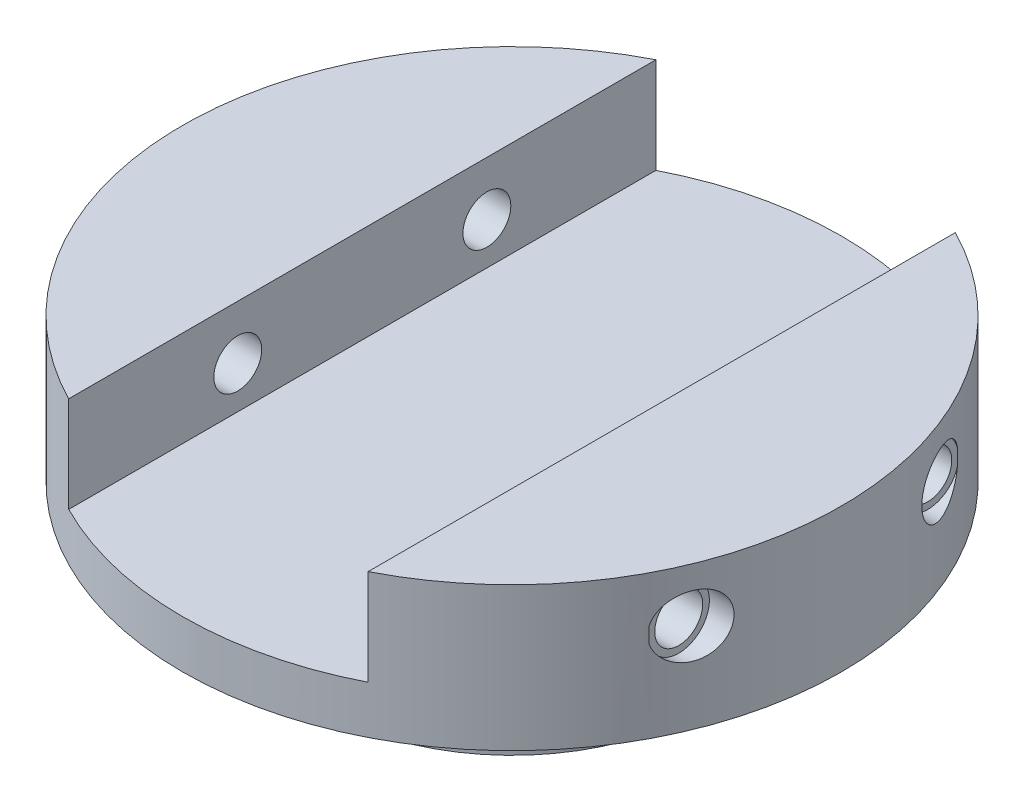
ISO-10303-21;
HEADER;
FILE_DESCRIPTION(('STEP AP214'),'2;1');
FILE_NAME('part.step','',(''),(''),'','','');
FILE_SCHEMA(('AUTOMOTIVE_DESIGN { 1 0 10303 214 1 1 1 1 }'));
ENDSEC;
DATA;
#1=APPLICATION_CONTEXT('core data for automotive mechanical design processes');
#2=APPLICATION_PROTOCOL_DEFINITION('international standard','automotive_design',2000,#1);
#3=PRODUCT_CONTEXT('',#1,'mechanical');
#4=PRODUCT('Part','Part','',(#3));
#5=PRODUCT_RELATED_PRODUCT_CATEGORY('part','',(#4));
#6=PRODUCT_DEFINITION_FORMATION('','',#4);
#7=PRODUCT_DEFINITION_CONTEXT('part definition',#1,'design');
#8=PRODUCT_DEFINITION('design','',#6,#7);
#9=PRODUCT_DEFINITION_SHAPE('','',#8);
#10=(LENGTH_UNIT() NAMED_UNIT(*) SI_UNIT(.MILLI.,.METRE.));
#11=(NAMED_UNIT(*) PLANE_ANGLE_UNIT() SI_UNIT($,.RADIAN.));
#12=(NAMED_UNIT(*) SI_UNIT($,.STERADIAN.) SOLID_ANGLE_UNIT());
#13=UNCERTAINTY_MEASURE_WITH_UNIT(LENGTH_MEASURE(1.E-05),#10,'distance_accuracy_value','');
#14=(GEOMETRIC_REPRESENTATION_CONTEXT(3) GLOBAL_UNCERTAINTY_ASSIGNED_CONTEXT((#13)) GLOBAL_UNIT_ASSIGNED_CONTEXT((#10,
#11,#12)) REPRESENTATION_CONTEXT('',''));
#15=CARTESIAN_POINT('',(0.,0.,0.));
#16=DIRECTION('',(0.,0.,1.));
#17=DIRECTION('',(1.,0.,0.));
#18=AXIS2_PLACEMENT_3D('',#15,#16,#17);
#19=CARTESIAN_POINT('',(0.,0.,0.));
#20=DIRECTION('',(0.,1.,0.));
#21=DIRECTION('',(0.,0.,1.));
#22=AXIS2_PLACEMENT_3D('',#19,#20,#21);
#23=PLANE('',#22);
#24=CARTESIAN_POINT('',(0.,0.,0.));
#25=DIRECTION('',(0.,1.,0.));
#26=DIRECTION('',(0.,0.,1.));
#27=AXIS2_PLACEMENT_3D('',#24,#25,#26);
#28=CIRCLE('',#27,43.688);
#29=CARTESIAN_POINT('',(0.,0.,43.688));
#30=VERTEX_POINT('',#29);
#31=EDGE_CURVE('E126',#30,#30,#28,.T.);
#32=ORIENTED_EDGE('',*,*,#31,.F.);
#33=EDGE_LOOP('',(#32));
#34=FACE_BOUND('',#33,.T.);
#35=CARTESIAN_POINT('',(0.,0.,0.));
#36=DIRECTION('',(0.,1.,0.));
#37=DIRECTION('',(0.,0.,1.));
#38=AXIS2_PLACEMENT_3D('',#35,#36,#37);
#39=CIRCLE('',#38,25.3746);
#40=CARTESIAN_POINT('',(0.,0.,25.3746));
#41=VERTEX_POINT('',#40);
#42=EDGE_CURVE('E140',#41,#41,#39,.F.);
#43=ORIENTED_EDGE('',*,*,#42,.F.);
#44=EDGE_LOOP('',(#43));
#45=FACE_BOUND('',#44,.T.);
#46=ADVANCED_FACE('F32',(#34,#45),#23,.F.);
#47=CARTESIAN_POINT('',(0.,19.05,0.));
#48=DIRECTION('',(0.,-1.,0.));
#49=DIRECTION('',(0.,0.,-1.));
#50=AXIS2_PLACEMENT_3D('',#47,#48,#49);
#51=CYLINDRICAL_SURFACE('',#50,43.688);
#52=DIRECTION('',(0.,-1.,0.));
#53=VECTOR('',#52,1.);
#54=CARTESIAN_POINT('',(-38.608,19.05,20.4466055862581));
#55=LINE('',#54,#53);
#56=CARTESIAN_POINT('',(-38.608,12.9221704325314,20.4466055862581));
#57=VERTEX_POINT('',#56);
#58=CARTESIAN_POINT('',(-38.608,10.9030295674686,20.4466055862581));
#59=VERTEX_POINT('',#58);
#60=EDGE_CURVE('E45',#57,#59,#55,.T.);
#61=ORIENTED_EDGE('',*,*,#60,.T.);
#62=CARTESIAN_POINT('',(-38.5402629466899,11.9126,20.574));
#63=CARTESIAN_POINT('',(-38.5402622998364,11.8076831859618,20.5740009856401));
#64=CARTESIAN_POINT('',(-38.542434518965,11.7027783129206,20.5699335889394));
#65=CARTESIAN_POINT('',(-38.5510852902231,11.4937384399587,20.5537162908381));
#66=CARTESIAN_POINT('',(-38.5575650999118,11.3896036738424,20.5415640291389));
#67=CARTESIAN_POINT('',(-38.5747304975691,11.182828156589,20.5093111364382));
#68=CARTESIAN_POINT('',(-38.5854200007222,11.0801888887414,20.4892031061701));
#69=CARTESIAN_POINT('',(-38.6108322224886,10.8771985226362,20.4412747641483));
#70=CARTESIAN_POINT('',(-38.6255565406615,10.776848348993,20.4134513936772));
#71=CARTESIAN_POINT('',(-38.6587452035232,10.5795148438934,20.3505287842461));
#72=CARTESIAN_POINT('',(-38.6771953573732,10.4825203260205,20.3154571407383));
#73=CARTESIAN_POINT('',(-38.7175990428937,10.2920810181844,20.2383487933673));
#74=CARTESIAN_POINT('',(-38.7395538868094,10.1986375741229,20.1963094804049));
#75=CARTESIAN_POINT('',(-38.8102184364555,9.92452760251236,20.0603768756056));
#76=CARTESIAN_POINT('',(-38.8637631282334,9.74987813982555,19.9566032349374));
#77=CARTESIAN_POINT('',(-38.9842541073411,9.41152651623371,19.7202367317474));
#78=CARTESIAN_POINT('',(-39.0517616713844,9.24890050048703,19.5864047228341));
#79=CARTESIAN_POINT('',(-39.1952806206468,8.94799212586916,19.2975990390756));
#80=CARTESIAN_POINT('',(-39.2712953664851,8.80971944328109,19.1426170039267));
#81=CARTESIAN_POINT('',(-39.437795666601,8.5456779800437,18.797398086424));
#82=CARTESIAN_POINT('',(-39.5289536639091,8.42294943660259,18.6051586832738));
#83=CARTESIAN_POINT('',(-39.7151125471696,8.21172511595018,18.2043964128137));
#84=CARTESIAN_POINT('',(-39.8101151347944,8.12324468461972,17.9958662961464));
#85=CARTESIAN_POINT('',(-40.0086460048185,7.97647124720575,17.5503160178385));
#86=CARTESIAN_POINT('',(-40.1122514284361,7.92113878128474,17.3123490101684));
#87=CARTESIAN_POINT('',(-40.3172653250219,7.85383824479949,16.8293880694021));
#88=CARTESIAN_POINT('',(-40.4186734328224,7.84187732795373,16.5843929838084));
#89=CARTESIAN_POINT('',(-40.6177841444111,7.86264567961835,16.0906423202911));
#90=CARTESIAN_POINT('',(-40.7154135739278,7.89601270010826,15.8418827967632));
#91=CARTESIAN_POINT('',(-40.9026719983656,8.00899812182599,15.3519224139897));
#92=CARTESIAN_POINT('',(-40.9923027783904,8.08860617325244,15.1107198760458));
#93=CARTESIAN_POINT('',(-41.1575069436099,8.28867043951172,14.6545996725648));
#94=CARTESIAN_POINT('',(-41.2335238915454,8.40718632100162,14.4389936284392));
#95=CARTESIAN_POINT('',(-41.374361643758,8.68334469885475,14.0303341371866));
#96=CARTESIAN_POINT('',(-41.439186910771,8.84097153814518,13.8372717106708));
#97=CARTESIAN_POINT('',(-41.5525731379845,9.1799676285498,13.4928081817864));
#98=CARTESIAN_POINT('',(-41.6019091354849,9.3591736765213,13.3395322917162));
#99=CARTESIAN_POINT('',(-41.6888482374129,9.74332305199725,13.0652989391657));
#100=CARTESIAN_POINT('',(-41.7264551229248,9.94825805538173,12.9443310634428));
#101=CARTESIAN_POINT('',(-41.7878095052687,10.3664811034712,12.7448301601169));
#102=CARTESIAN_POINT('',(-41.8121740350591,10.5787864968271,12.66442351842));
#103=CARTESIAN_POINT('',(-41.8496743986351,11.0147366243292,12.5399509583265));
#104=CARTESIAN_POINT('',(-41.8628123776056,11.2383791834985,12.4958780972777));
#105=CARTESIAN_POINT('',(-41.8775346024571,11.6837033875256,12.4464486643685));
#106=CARTESIAN_POINT('',(-41.8794416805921,11.9052550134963,12.4400103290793));
#107=CARTESIAN_POINT('',(-41.8725525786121,12.346286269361,12.4631788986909));
#108=CARTESIAN_POINT('',(-41.8637572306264,12.5657660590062,12.4927830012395));
#109=CARTESIAN_POINT('',(-41.8356389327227,12.994745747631,12.5866200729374));
#110=CARTESIAN_POINT('',(-41.8163951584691,13.2043079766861,12.650592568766));
#111=CARTESIAN_POINT('',(-41.7676017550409,13.6094268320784,12.8107670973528));
#112=CARTESIAN_POINT('',(-41.7380519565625,13.8049832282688,12.9069696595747));
#113=CARTESIAN_POINT('',(-41.6685352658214,14.1791906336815,13.1296696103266));
#114=CARTESIAN_POINT('',(-41.6284482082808,14.3576119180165,13.2565149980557));
#115=CARTESIAN_POINT('',(-41.538526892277,14.6904555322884,13.5356411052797));
#116=CARTESIAN_POINT('',(-41.4886915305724,14.8448751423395,13.6879247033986));
#117=CARTESIAN_POINT('',(-41.3782426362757,15.1308171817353,14.0183313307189));
#118=CARTESIAN_POINT('',(-41.3173359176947,15.2614517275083,14.197123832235));
#119=CARTESIAN_POINT('',(-41.1869226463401,15.4910188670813,14.5711346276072));
#120=CARTESIAN_POINT('',(-41.1174142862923,15.5899447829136,14.7663563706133));
#121=CARTESIAN_POINT('',(-40.9673081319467,15.7588751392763,15.1779892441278));
#122=CARTESIAN_POINT('',(-40.8863246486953,15.8271382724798,15.39497354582));
#123=CARTESIAN_POINT('',(-40.717974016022,15.9264766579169,15.8348810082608));
#124=CARTESIAN_POINT('',(-40.6306049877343,15.9575409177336,16.0578059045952));
#125=CARTESIAN_POINT('',(-40.4459386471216,15.9835042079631,16.5176397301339));
#126=CARTESIAN_POINT('',(-40.3483610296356,15.9760699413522,16.7545683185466));
#127=CARTESIAN_POINT('',(-40.1508034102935,15.9205709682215,17.2226284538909));
#128=CARTESIAN_POINT('',(-40.0508226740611,15.8724936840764,17.4537581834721));
#129=CARTESIAN_POINT('',(-39.8467308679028,15.7339667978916,17.9149631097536));
#130=CARTESIAN_POINT('',(-39.7426440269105,15.6416500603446,18.1444890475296));
#131=CARTESIAN_POINT('',(-39.5386996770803,15.4158553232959,18.5847080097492));
#132=CARTESIAN_POINT('',(-39.4388429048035,15.2823701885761,18.7953977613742));
#133=CARTESIAN_POINT('',(-39.2959196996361,15.0538738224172,19.0914662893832));
#134=CARTESIAN_POINT('',(-39.2495355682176,14.9732462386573,19.1866034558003));
#135=CARTESIAN_POINT('',(-39.1594922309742,14.8028827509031,19.3697155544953));
#136=CARTESIAN_POINT('',(-39.1158317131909,14.7131512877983,19.4576939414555));
#137=CARTESIAN_POINT('',(-39.0318258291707,14.5250011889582,19.625665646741));
#138=CARTESIAN_POINT('',(-38.9914818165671,14.4265790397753,19.7056557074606));
#139=CARTESIAN_POINT('',(-38.9147883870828,14.2217135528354,19.8566804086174));
#140=CARTESIAN_POINT('',(-38.878436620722,14.1152749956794,19.9277203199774));
#141=CARTESIAN_POINT('',(-38.8131031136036,13.9039526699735,20.0546516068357));
#142=CARTESIAN_POINT('',(-38.7837634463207,13.7996356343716,20.1113025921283));
#143=CARTESIAN_POINT('',(-38.7295020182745,13.5855590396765,20.2155997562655));
#144=CARTESIAN_POINT('',(-38.7045777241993,13.4758026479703,20.2632510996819));
#145=CARTESIAN_POINT('',(-38.6596359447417,13.2518422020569,20.3488630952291));
#146=CARTESIAN_POINT('',(-38.63960925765,13.1376469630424,20.386841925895));
#147=CARTESIAN_POINT('',(-38.6048160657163,12.9056431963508,20.4526503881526));
#148=CARTESIAN_POINT('',(-38.5900469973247,12.7878364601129,20.4804849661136));
#149=CARTESIAN_POINT('',(-38.5655673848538,12.5445976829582,20.5265454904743));
#150=CARTESIAN_POINT('',(-38.5560980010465,12.419054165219,20.5443137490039));
#151=CARTESIAN_POINT('',(-38.5434462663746,12.1665345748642,20.5680402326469));
#152=CARTESIAN_POINT('',(-38.5402637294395,12.0395585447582,20.573998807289));
#153=CARTESIAN_POINT('',(-38.5402629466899,11.9126,20.574));
#154=B_SPLINE_CURVE_WITH_KNOTS('',3,(#62,#63,#64,#65,#66,#67,#68,#69,#70,#71,#72,#73,#74,#75,
#76,#77,#78,#79,#80,#81,#82,#83,#84,#85,#86,#87,#88,#89,#90,#91,#92,#93,#94,#95,#96,#97,#98,#99,
#100,#101,#102,#103,#104,#105,#106,#107,#108,#109,#110,#111,#112,#113,#114,#115,#116,#117,#118,
#119,#120,#121,#122,#123,#124,#125,#126,#127,#128,#129,#130,#131,#132,#133,#134,#135,#136,#137,
#138,#139,#140,#141,#142,#143,#144,#145,#146,#147,#148,#149,#150,#151,#152,#153),.UNSPECIFIED.,
.T.,.F.,(4,2,2,2,2,2,2,2,2,2,2,2,2,2,2,2,2,2,2,2,2,2,2,2,2,2,2,2,2,2,2,2,2,2,2,2,2,2,2,2,2,2,2,
2,2,4),(0.,0.314629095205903,0.629350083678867,0.94436446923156,1.25950392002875,
1.57346497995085,1.88754387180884,2.51505976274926,3.17594778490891,3.83709780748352,
4.5708465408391,5.30492367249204,6.09738351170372,6.88997405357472,7.69383239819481,
8.49751089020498,9.26601413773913,10.0342102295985,10.7532758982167,11.4721095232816,
12.1537057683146,12.8351717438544,13.4969495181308,14.1586758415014,14.815456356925,
15.4722476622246,16.1368809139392,16.8015894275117,17.4875087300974,18.1735723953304,
18.8947835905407,19.6162078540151,20.381848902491,21.1477269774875,21.9492341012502,
22.7508802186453,23.1496074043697,23.5481410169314,23.9468364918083,24.3452960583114,
24.7116248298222,25.0777427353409,25.4431673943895,25.8084136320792,26.189153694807,
26.5698824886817),.UNSPECIFIED.);
#155=EDGE_CURVE('E11',#59,#57,#154,.T.);
#156=ORIENTED_EDGE('',*,*,#155,.T.);
#157=EDGE_LOOP('',(#61,#156));
#158=FACE_BOUND('',#157,.T.);
#159=DIRECTION('',(0.,-1.,0.));
#160=VECTOR('',#159,1.);
#161=CARTESIAN_POINT('',(-38.608,19.05,-20.4466055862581));
#162=LINE('',#161,#160);
#163=CARTESIAN_POINT('',(-38.608,10.9030295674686,-20.4466055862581));
#164=VERTEX_POINT('',#163);
#165=CARTESIAN_POINT('',(-38.608,12.9221704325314,-20.4466055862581));
#166=VERTEX_POINT('',#165);
#167=EDGE_CURVE('E114',#164,#166,#162,.F.);
#168=ORIENTED_EDGE('',*,*,#167,.T.);
#169=CARTESIAN_POINT('',(-38.5402629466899,11.9126,-20.574));
#170=CARTESIAN_POINT('',(-38.5402622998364,12.0175168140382,-20.5740009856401));
#171=CARTESIAN_POINT('',(-38.542434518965,12.1224216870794,-20.5699335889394));
#172=CARTESIAN_POINT('',(-38.5510852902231,12.3314615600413,-20.5537162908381));
#173=CARTESIAN_POINT('',(-38.5575650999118,12.4355963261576,-20.5415640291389));
#174=CARTESIAN_POINT('',(-38.5747304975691,12.642371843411,-20.5093111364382));
#175=CARTESIAN_POINT('',(-38.5854200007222,12.7450111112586,-20.4892031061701));
#176=CARTESIAN_POINT('',(-38.6108322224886,12.9480014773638,-20.4412747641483));
#177=CARTESIAN_POINT('',(-38.6255565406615,13.048351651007,-20.4134513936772));
#178=CARTESIAN_POINT('',(-38.6587452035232,13.2456851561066,-20.3505287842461));
#179=CARTESIAN_POINT('',(-38.6771953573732,13.3426796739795,-20.3154571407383));
#180=CARTESIAN_POINT('',(-38.7175990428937,13.5331189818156,-20.2383487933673));
#181=CARTESIAN_POINT('',(-38.7395538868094,13.6265624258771,-20.1963094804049));
#182=CARTESIAN_POINT('',(-38.8102184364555,13.9006723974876,-20.0603768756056));
#183=CARTESIAN_POINT('',(-38.8637631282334,14.0753218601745,-19.9566032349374));
#184=CARTESIAN_POINT('',(-38.9842541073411,14.4136734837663,-19.7202367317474));
#185=CARTESIAN_POINT('',(-39.0517616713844,14.576299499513,-19.5864047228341));
#186=CARTESIAN_POINT('',(-39.1952806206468,14.8772078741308,-19.2975990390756));
#187=CARTESIAN_POINT('',(-39.2712953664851,15.0154805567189,-19.1426170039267));
#188=CARTESIAN_POINT('',(-39.437795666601,15.2795220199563,-18.797398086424));
#189=CARTESIAN_POINT('',(-39.5289536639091,15.4022505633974,-18.6051586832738));
#190=CARTESIAN_POINT('',(-39.7151125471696,15.6134748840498,-18.2043964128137));
#191=CARTESIAN_POINT('',(-39.8101151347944,15.7019553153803,-17.9958662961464));
#192=CARTESIAN_POINT('',(-40.0086460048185,15.8487287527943,-17.5503160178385));
#193=CARTESIAN_POINT('',(-40.1122514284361,15.9040612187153,-17.3123490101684));
#194=CARTESIAN_POINT('',(-40.3172653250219,15.9713617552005,-16.8293880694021));
#195=CARTESIAN_POINT('',(-40.4186734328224,15.9833226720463,-16.5843929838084));
#196=CARTESIAN_POINT('',(-40.6177841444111,15.9625543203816,-16.0906423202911));
#197=CARTESIAN_POINT('',(-40.7154135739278,15.9291872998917,-15.8418827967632));
#198=CARTESIAN_POINT('',(-40.9026719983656,15.816201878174,-15.3519224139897));
#199=CARTESIAN_POINT('',(-40.9923027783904,15.7365938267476,-15.1107198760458));
#200=CARTESIAN_POINT('',(-41.15750694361,15.5365295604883,-14.6545996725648));
#201=CARTESIAN_POINT('',(-41.2335238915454,15.4180136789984,-14.4389936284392));
#202=CARTESIAN_POINT('',(-41.3743616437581,15.1418553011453,-14.0303341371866));
#203=CARTESIAN_POINT('',(-41.439186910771,14.9842284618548,-13.8372717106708));
#204=CARTESIAN_POINT('',(-41.5525731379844,14.6452323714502,-13.4928081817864));
#205=CARTESIAN_POINT('',(-41.6019091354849,14.4660263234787,-13.3395322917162));
#206=CARTESIAN_POINT('',(-41.6888482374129,14.0818769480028,-13.0652989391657));
#207=CARTESIAN_POINT('',(-41.7264551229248,13.8769419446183,-12.9443310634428));
#208=CARTESIAN_POINT('',(-41.7878095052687,13.4587188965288,-12.7448301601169));
#209=CARTESIAN_POINT('',(-41.8121740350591,13.2464135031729,-12.66442351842));
#210=CARTESIAN_POINT('',(-41.8496743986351,12.8104633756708,-12.5399509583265));
#211=CARTESIAN_POINT('',(-41.8628123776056,12.5868208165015,-12.4958780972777));
#212=CARTESIAN_POINT('',(-41.8775346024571,12.1414966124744,-12.4464486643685));
#213=CARTESIAN_POINT('',(-41.8794416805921,11.9199449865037,-12.4400103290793));
#214=CARTESIAN_POINT('',(-41.8725525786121,11.478913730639,-12.4631788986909));
#215=CARTESIAN_POINT('',(-41.8637572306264,11.2594339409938,-12.4927830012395));
#216=CARTESIAN_POINT('',(-41.8356389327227,10.830454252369,-12.5866200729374));
#217=CARTESIAN_POINT('',(-41.8163951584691,10.6208920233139,-12.650592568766));
#218=CARTESIAN_POINT('',(-41.7676017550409,10.2157731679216,-12.8107670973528));
#219=CARTESIAN_POINT('',(-41.7380519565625,10.0202167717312,-12.9069696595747));
#220=CARTESIAN_POINT('',(-41.6685352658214,9.64600936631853,-13.1296696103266));
#221=CARTESIAN_POINT('',(-41.6284482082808,9.46758808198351,-13.2565149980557));
#222=CARTESIAN_POINT('',(-41.538526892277,9.13474446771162,-13.5356411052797));
#223=CARTESIAN_POINT('',(-41.4886915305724,8.98032485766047,-13.6879247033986));
#224=CARTESIAN_POINT('',(-41.3782426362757,8.69438281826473,-14.0183313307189));
#225=CARTESIAN_POINT('',(-41.3173359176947,8.56374827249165,-14.197123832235));
#226=CARTESIAN_POINT('',(-41.1869226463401,8.33418113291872,-14.5711346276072));
#227=CARTESIAN_POINT('',(-41.1174142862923,8.23525521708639,-14.7663563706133));
#228=CARTESIAN_POINT('',(-40.9673081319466,8.06632486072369,-15.1779892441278));
#229=CARTESIAN_POINT('',(-40.8863246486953,7.99806172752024,-15.39497354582));
#230=CARTESIAN_POINT('',(-40.717974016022,7.8987233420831,-15.8348810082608));
#231=CARTESIAN_POINT('',(-40.6306049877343,7.86765908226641,-16.0578059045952));
#232=CARTESIAN_POINT('',(-40.4459386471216,7.84169579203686,-16.5176397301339));
#233=CARTESIAN_POINT('',(-40.3483610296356,7.8491300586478,-16.7545683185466));
#234=CARTESIAN_POINT('',(-40.1508034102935,7.90462903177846,-17.2226284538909));
#235=CARTESIAN_POINT('',(-40.0508226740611,7.95270631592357,-17.4537581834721));
#236=CARTESIAN_POINT('',(-39.8467308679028,8.09123320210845,-17.9149631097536));
#237=CARTESIAN_POINT('',(-39.7426440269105,8.18354993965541,-18.1444890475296));
#238=CARTESIAN_POINT('',(-39.5386996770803,8.40934467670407,-18.5847080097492));
#239=CARTESIAN_POINT('',(-39.4388429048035,8.54282981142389,-18.7953977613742));
#240=CARTESIAN_POINT('',(-39.2959196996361,8.7713261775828,-19.0914662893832));
#241=CARTESIAN_POINT('',(-39.2495355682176,8.85195376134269,-19.1866034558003));
#242=CARTESIAN_POINT('',(-39.1594922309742,9.02231724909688,-19.3697155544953));
#243=CARTESIAN_POINT('',(-39.1158317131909,9.11204871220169,-19.4576939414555));
#244=CARTESIAN_POINT('',(-39.0318258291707,9.30019881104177,-19.625665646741));
#245=CARTESIAN_POINT('',(-38.9914818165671,9.39862096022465,-19.7056557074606));
#246=CARTESIAN_POINT('',(-38.9147883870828,9.60348644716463,-19.8566804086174));
#247=CARTESIAN_POINT('',(-38.878436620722,9.70992500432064,-19.9277203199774));
#248=CARTESIAN_POINT('',(-38.8131031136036,9.92124733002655,-20.0546516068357));
#249=CARTESIAN_POINT('',(-38.7837634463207,10.0255643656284,-20.1113025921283));
#250=CARTESIAN_POINT('',(-38.7295020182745,10.2396409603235,-20.2155997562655));
#251=CARTESIAN_POINT('',(-38.7045777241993,10.3493973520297,-20.2632510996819));
#252=CARTESIAN_POINT('',(-38.6596359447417,10.5733577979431,-20.3488630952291));
#253=CARTESIAN_POINT('',(-38.63960925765,10.6875530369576,-20.386841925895));
#254=CARTESIAN_POINT('',(-38.6048160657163,10.9195568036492,-20.4526503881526));
#255=CARTESIAN_POINT('',(-38.5900469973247,11.0373635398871,-20.4804849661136));
#256=CARTESIAN_POINT('',(-38.5655673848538,11.2806023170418,-20.5265454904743));
#257=CARTESIAN_POINT('',(-38.5560980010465,11.406145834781,-20.5443137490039));
#258=CARTESIAN_POINT('',(-38.5434462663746,11.6586654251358,-20.5680402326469));
#259=CARTESIAN_POINT('',(-38.5402637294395,11.7856414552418,-20.573998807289));
#260=CARTESIAN_POINT('',(-38.5402629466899,11.9126,-20.574));
#261=B_SPLINE_CURVE_WITH_KNOTS('',3,(#169,#170,#171,#172,#173,#174,#175,#176,#177,#178,#179,
#180,#181,#182,#183,#184,#185,#186,#187,#188,#189,#190,#191,#192,#193,#194,#195,#196,#197,#198,
#199,#200,#201,#202,#203,#204,#205,#206,#207,#208,#209,#210,#211,#212,#213,#214,#215,#216,#217,
#218,#219,#220,#221,#222,#223,#224,#225,#226,#227,#228,#229,#230,#231,#232,#233,#234,#235,#236,
#237,#238,#239,#240,#241,#242,#243,#244,#245,#246,#247,#248,#249,#250,#251,#252,#253,#254,#255,
#256,#257,#258,#259,#260),.UNSPECIFIED.,.T.,.F.,(4,2,2,2,2,2,2,2,2,2,2,2,2,2,2,2,2,2,2,2,2,2,2,
2,2,2,2,2,2,2,2,2,2,2,2,2,2,2,2,2,2,2,2,2,2,4),(0.,0.314629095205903,0.629350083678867,
0.94436446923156,1.25950392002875,1.57346497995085,1.88754387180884,2.51505976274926,
3.17594778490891,3.83709780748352,4.5708465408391,5.30492367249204,6.09738351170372,
6.88997405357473,7.69383239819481,8.49751089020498,9.26601413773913,10.0342102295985,
10.7532758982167,11.4721095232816,12.1537057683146,12.8351717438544,13.4969495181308,
14.1586758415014,14.815456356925,15.4722476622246,16.1368809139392,16.8015894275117,
17.4875087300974,18.1735723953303,18.8947835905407,19.6162078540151,20.381848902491,
21.1477269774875,21.9492341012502,22.7508802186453,23.1496074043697,23.5481410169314,
23.9468364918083,24.3452960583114,24.7116248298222,25.0777427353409,25.4431673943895,
25.8084136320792,26.189153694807,26.5698824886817),.UNSPECIFIED.);
#262=EDGE_CURVE('E102',#166,#164,#261,.T.);
#263=ORIENTED_EDGE('',*,*,#262,.T.);
#264=EDGE_LOOP('',(#168,#263));
#265=FACE_BOUND('',#264,.T.);
#266=DIRECTION('',(0.,-1.,0.));
#267=VECTOR('',#266,1.);
#268=CARTESIAN_POINT('',(38.608,19.05,-20.4466055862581));
#269=LINE('',#268,#267);
#270=CARTESIAN_POINT('',(38.608,12.9221704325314,-20.4466055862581));
#271=VERTEX_POINT('',#270);
#272=CARTESIAN_POINT('',(38.608,10.9030295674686,-20.4466055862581));
#273=VERTEX_POINT('',#272);
#274=EDGE_CURVE('E118',#271,#273,#269,.T.);
#275=ORIENTED_EDGE('',*,*,#274,.T.);
#276=CARTESIAN_POINT('',(38.5402629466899,11.9126,-20.574));
#277=CARTESIAN_POINT('',(38.5402622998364,11.8076831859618,-20.5740009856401));
#278=CARTESIAN_POINT('',(38.542434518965,11.7027783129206,-20.5699335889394));
#279=CARTESIAN_POINT('',(38.5510852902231,11.4937384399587,-20.5537162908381));
#280=CARTESIAN_POINT('',(38.5575650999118,11.3896036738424,-20.5415640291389));
#281=CARTESIAN_POINT('',(38.5747304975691,11.182828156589,-20.5093111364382));
#282=CARTESIAN_POINT('',(38.5854200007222,11.0801888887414,-20.4892031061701));
#283=CARTESIAN_POINT('',(38.6108322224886,10.8771985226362,-20.4412747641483));
#284=CARTESIAN_POINT('',(38.6255565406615,10.776848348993,-20.4134513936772));
#285=CARTESIAN_POINT('',(38.6587452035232,10.5795148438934,-20.3505287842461));
#286=CARTESIAN_POINT('',(38.6771953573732,10.4825203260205,-20.3154571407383));
#287=CARTESIAN_POINT('',(38.7175990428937,10.2920810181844,-20.2383487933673));
#288=CARTESIAN_POINT('',(38.7395538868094,10.1986375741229,-20.1963094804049));
#289=CARTESIAN_POINT('',(38.8102184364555,9.92452760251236,-20.0603768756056));
#290=CARTESIAN_POINT('',(38.8637631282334,9.74987813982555,-19.9566032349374));
#291=CARTESIAN_POINT('',(38.9842541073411,9.41152651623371,-19.7202367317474));
#292=CARTESIAN_POINT('',(39.0517616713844,9.24890050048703,-19.5864047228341));
#293=CARTESIAN_POINT('',(39.1952806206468,8.94799212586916,-19.2975990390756));
#294=CARTESIAN_POINT('',(39.2712953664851,8.80971944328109,-19.1426170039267));
#295=CARTESIAN_POINT('',(39.437795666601,8.5456779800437,-18.797398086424));
#296=CARTESIAN_POINT('',(39.5289536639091,8.42294943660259,-18.6051586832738));
#297=CARTESIAN_POINT('',(39.7151125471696,8.21172511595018,-18.2043964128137));
#298=CARTESIAN_POINT('',(39.8101151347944,8.12324468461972,-17.9958662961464));
#299=CARTESIAN_POINT('',(40.0086460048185,7.97647124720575,-17.5503160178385));
#300=CARTESIAN_POINT('',(40.1122514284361,7.92113878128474,-17.3123490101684));
#301=CARTESIAN_POINT('',(40.3172653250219,7.85383824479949,-16.8293880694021));
#302=CARTESIAN_POINT('',(40.4186734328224,7.84187732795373,-16.5843929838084));
#303=CARTESIAN_POINT('',(40.6177841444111,7.86264567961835,-16.0906423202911));
#304=CARTESIAN_POINT('',(40.7154135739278,7.89601270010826,-15.8418827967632));
#305=CARTESIAN_POINT('',(40.9026719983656,8.00899812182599,-15.3519224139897));
#306=CARTESIAN_POINT('',(40.9923027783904,8.08860617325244,-15.1107198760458));
#307=CARTESIAN_POINT('',(41.1575069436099,8.28867043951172,-14.6545996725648));
#308=CARTESIAN_POINT('',(41.2335238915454,8.40718632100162,-14.4389936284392));
#309=CARTESIAN_POINT('',(41.374361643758,8.68334469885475,-14.0303341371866));
#310=CARTESIAN_POINT('',(41.439186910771,8.84097153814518,-13.8372717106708));
#311=CARTESIAN_POINT('',(41.5525731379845,9.1799676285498,-13.4928081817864));
#312=CARTESIAN_POINT('',(41.6019091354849,9.3591736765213,-13.3395322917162));
#313=CARTESIAN_POINT('',(41.6888482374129,9.74332305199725,-13.0652989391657));
#314=CARTESIAN_POINT('',(41.7264551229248,9.94825805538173,-12.9443310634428));
#315=CARTESIAN_POINT('',(41.7878095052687,10.3664811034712,-12.7448301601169));
#316=CARTESIAN_POINT('',(41.8121740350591,10.5787864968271,-12.66442351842));
#317=CARTESIAN_POINT('',(41.8496743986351,11.0147366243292,-12.5399509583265));
#318=CARTESIAN_POINT('',(41.8628123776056,11.2383791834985,-12.4958780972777));
#319=CARTESIAN_POINT('',(41.8775346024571,11.6837033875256,-12.4464486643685));
#320=CARTESIAN_POINT('',(41.8794416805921,11.9052550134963,-12.4400103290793));
#321=CARTESIAN_POINT('',(41.8725525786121,12.346286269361,-12.4631788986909));
#322=CARTESIAN_POINT('',(41.8637572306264,12.5657660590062,-12.4927830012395));
#323=CARTESIAN_POINT('',(41.8356389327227,12.994745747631,-12.5866200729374));
#324=CARTESIAN_POINT('',(41.8163951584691,13.2043079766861,-12.650592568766));
#325=CARTESIAN_POINT('',(41.7676017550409,13.6094268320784,-12.8107670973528));
#326=CARTESIAN_POINT('',(41.7380519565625,13.8049832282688,-12.9069696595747));
#327=CARTESIAN_POINT('',(41.6685352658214,14.1791906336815,-13.1296696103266));
#328=CARTESIAN_POINT('',(41.6284482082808,14.3576119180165,-13.2565149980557));
#329=CARTESIAN_POINT('',(41.538526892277,14.6904555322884,-13.5356411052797));
#330=CARTESIAN_POINT('',(41.4886915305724,14.8448751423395,-13.6879247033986));
#331=CARTESIAN_POINT('',(41.3782426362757,15.1308171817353,-14.0183313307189));
#332=CARTESIAN_POINT('',(41.3173359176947,15.2614517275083,-14.197123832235));
#333=CARTESIAN_POINT('',(41.1869226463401,15.4910188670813,-14.5711346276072));
#334=CARTESIAN_POINT('',(41.1174142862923,15.5899447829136,-14.7663563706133));
#335=CARTESIAN_POINT('',(40.9673081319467,15.7588751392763,-15.1779892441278));
#336=CARTESIAN_POINT('',(40.8863246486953,15.8271382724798,-15.39497354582));
#337=CARTESIAN_POINT('',(40.717974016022,15.9264766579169,-15.8348810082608));
#338=CARTESIAN_POINT('',(40.6306049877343,15.9575409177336,-16.0578059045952));
#339=CARTESIAN_POINT('',(40.4459386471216,15.9835042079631,-16.5176397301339));
#340=CARTESIAN_POINT('',(40.3483610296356,15.9760699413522,-16.7545683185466));
#341=CARTESIAN_POINT('',(40.1508034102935,15.9205709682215,-17.2226284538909));
#342=CARTESIAN_POINT('',(40.0508226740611,15.8724936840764,-17.4537581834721));
#343=CARTESIAN_POINT('',(39.8467308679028,15.7339667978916,-17.9149631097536));
#344=CARTESIAN_POINT('',(39.7426440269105,15.6416500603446,-18.1444890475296));
#345=CARTESIAN_POINT('',(39.5386996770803,15.4158553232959,-18.5847080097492));
#346=CARTESIAN_POINT('',(39.4388429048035,15.2823701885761,-18.7953977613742));
#347=CARTESIAN_POINT('',(39.2959196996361,15.0538738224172,-19.0914662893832));
#348=CARTESIAN_POINT('',(39.2495355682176,14.9732462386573,-19.1866034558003));
#349=CARTESIAN_POINT('',(39.1594922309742,14.8028827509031,-19.3697155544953));
#350=CARTESIAN_POINT('',(39.1158317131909,14.7131512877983,-19.4576939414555));
#351=CARTESIAN_POINT('',(39.0318258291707,14.5250011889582,-19.625665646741));
#352=CARTESIAN_POINT('',(38.9914818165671,14.4265790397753,-19.7056557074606));
#353=CARTESIAN_POINT('',(38.9147883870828,14.2217135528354,-19.8566804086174));
#354=CARTESIAN_POINT('',(38.878436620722,14.1152749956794,-19.9277203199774));
#355=CARTESIAN_POINT('',(38.8131031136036,13.9039526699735,-20.0546516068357));
#356=CARTESIAN_POINT('',(38.7837634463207,13.7996356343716,-20.1113025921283));
#357=CARTESIAN_POINT('',(38.7295020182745,13.5855590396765,-20.2155997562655));
#358=CARTESIAN_POINT('',(38.7045777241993,13.4758026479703,-20.2632510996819));
#359=CARTESIAN_POINT('',(38.6596359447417,13.2518422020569,-20.3488630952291));
#360=CARTESIAN_POINT('',(38.63960925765,13.1376469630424,-20.386841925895));
#361=CARTESIAN_POINT('',(38.6048160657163,12.9056431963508,-20.4526503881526));
#362=CARTESIAN_POINT('',(38.5900469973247,12.7878364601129,-20.4804849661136));
#363=CARTESIAN_POINT('',(38.5655673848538,12.5445976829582,-20.5265454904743));
#364=CARTESIAN_POINT('',(38.5560980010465,12.419054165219,-20.5443137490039));
#365=CARTESIAN_POINT('',(38.5434462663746,12.1665345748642,-20.5680402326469));
#366=CARTESIAN_POINT('',(38.5402637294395,12.0395585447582,-20.573998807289));
#367=CARTESIAN_POINT('',(38.5402629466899,11.9126,-20.574));
#368=B_SPLINE_CURVE_WITH_KNOTS('',3,(#276,#277,#278,#279,#280,#281,#282,#283,#284,#285,#286,
#287,#288,#289,#290,#291,#292,#293,#294,#295,#296,#297,#298,#299,#300,#301,#302,#303,#304,#305,
#306,#307,#308,#309,#310,#311,#312,#313,#314,#315,#316,#317,#318,#319,#320,#321,#322,#323,#324,
#325,#326,#327,#328,#329,#330,#331,#332,#333,#334,#335,#336,#337,#338,#339,#340,#341,#342,#343,
#344,#345,#346,#347,#348,#349,#350,#351,#352,#353,#354,#355,#356,#357,#358,#359,#360,#361,#362,
#363,#364,#365,#366,#367),.UNSPECIFIED.,.T.,.F.,(4,2,2,2,2,2,2,2,2,2,2,2,2,2,2,2,2,2,2,2,2,2,2,
2,2,2,2,2,2,2,2,2,2,2,2,2,2,2,2,2,2,2,2,2,2,4),(0.,0.314629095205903,0.629350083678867,
0.94436446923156,1.25950392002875,1.57346497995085,1.88754387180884,2.51505976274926,
3.17594778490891,3.83709780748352,4.5708465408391,5.30492367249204,6.09738351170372,
6.88997405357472,7.69383239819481,8.49751089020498,9.26601413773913,10.0342102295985,
10.7532758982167,11.4721095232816,12.1537057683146,12.8351717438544,13.4969495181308,
14.1586758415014,14.815456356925,15.4722476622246,16.1368809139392,16.8015894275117,
17.4875087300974,18.1735723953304,18.8947835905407,19.6162078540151,20.381848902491,
21.1477269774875,21.9492341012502,22.7508802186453,23.1496074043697,23.5481410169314,
23.9468364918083,24.3452960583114,24.7116248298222,25.0777427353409,25.4431673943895,
25.8084136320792,26.189153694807,26.5698824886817),.UNSPECIFIED.);
#369=EDGE_CURVE('E474',#273,#271,#368,.T.);
#370=ORIENTED_EDGE('',*,*,#369,.T.);
#371=EDGE_LOOP('',(#275,#370));
#372=FACE_BOUND('',#371,.T.);
#373=DIRECTION('',(0.,-1.,0.));
#374=VECTOR('',#373,1.);
#375=CARTESIAN_POINT('',(38.608,19.05,20.4466055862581));
#376=LINE('',#375,#374);
#377=CARTESIAN_POINT('',(38.608,10.9030295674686,20.4466055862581));
#378=VERTEX_POINT('',#377);
#379=CARTESIAN_POINT('',(38.608,12.9221704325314,20.4466055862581));
#380=VERTEX_POINT('',#379);
#381=EDGE_CURVE('E122',#378,#380,#376,.F.);
#382=ORIENTED_EDGE('',*,*,#381,.T.);
#383=CARTESIAN_POINT('',(38.5402629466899,11.9126,20.574));
#384=CARTESIAN_POINT('',(38.5402622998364,12.0175168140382,20.5740009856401));
#385=CARTESIAN_POINT('',(38.542434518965,12.1224216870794,20.5699335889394));
#386=CARTESIAN_POINT('',(38.5510852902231,12.3314615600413,20.5537162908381));
#387=CARTESIAN_POINT('',(38.5575650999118,12.4355963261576,20.5415640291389));
#388=CARTESIAN_POINT('',(38.5747304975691,12.642371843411,20.5093111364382));
#389=CARTESIAN_POINT('',(38.5854200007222,12.7450111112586,20.4892031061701));
#390=CARTESIAN_POINT('',(38.6108322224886,12.9480014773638,20.4412747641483));
#391=CARTESIAN_POINT('',(38.6255565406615,13.048351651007,20.4134513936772));
#392=CARTESIAN_POINT('',(38.6587452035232,13.2456851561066,20.3505287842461));
#393=CARTESIAN_POINT('',(38.6771953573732,13.3426796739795,20.3154571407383));
#394=CARTESIAN_POINT('',(38.7175990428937,13.5331189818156,20.2383487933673));
#395=CARTESIAN_POINT('',(38.7395538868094,13.6265624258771,20.1963094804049));
#396=CARTESIAN_POINT('',(38.8102184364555,13.9006723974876,20.0603768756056));
#397=CARTESIAN_POINT('',(38.8637631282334,14.0753218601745,19.9566032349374));
#398=CARTESIAN_POINT('',(38.9842541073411,14.4136734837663,19.7202367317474));
#399=CARTESIAN_POINT('',(39.0517616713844,14.576299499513,19.5864047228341));
#400=CARTESIAN_POINT('',(39.1952806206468,14.8772078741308,19.2975990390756));
#401=CARTESIAN_POINT('',(39.2712953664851,15.0154805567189,19.1426170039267));
#402=CARTESIAN_POINT('',(39.437795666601,15.2795220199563,18.797398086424));
#403=CARTESIAN_POINT('',(39.5289536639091,15.4022505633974,18.6051586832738));
#404=CARTESIAN_POINT('',(39.7151125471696,15.6134748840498,18.2043964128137));
#405=CARTESIAN_POINT('',(39.8101151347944,15.7019553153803,17.9958662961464));
#406=CARTESIAN_POINT('',(40.0086460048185,15.8487287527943,17.5503160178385));
#407=CARTESIAN_POINT('',(40.1122514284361,15.9040612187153,17.3123490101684));
#408=CARTESIAN_POINT('',(40.3172653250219,15.9713617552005,16.8293880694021));
#409=CARTESIAN_POINT('',(40.4186734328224,15.9833226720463,16.5843929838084));
#410=CARTESIAN_POINT('',(40.6177841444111,15.9625543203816,16.0906423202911));
#411=CARTESIAN_POINT('',(40.7154135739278,15.9291872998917,15.8418827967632));
#412=CARTESIAN_POINT('',(40.9026719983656,15.816201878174,15.3519224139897));
#413=CARTESIAN_POINT('',(40.9923027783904,15.7365938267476,15.1107198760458));
#414=CARTESIAN_POINT('',(41.15750694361,15.5365295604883,14.6545996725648));
#415=CARTESIAN_POINT('',(41.2335238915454,15.4180136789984,14.4389936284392));
#416=CARTESIAN_POINT('',(41.3743616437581,15.1418553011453,14.0303341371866));
#417=CARTESIAN_POINT('',(41.439186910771,14.9842284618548,13.8372717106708));
#418=CARTESIAN_POINT('',(41.5525731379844,14.6452323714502,13.4928081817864));
#419=CARTESIAN_POINT('',(41.6019091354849,14.4660263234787,13.3395322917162));
#420=CARTESIAN_POINT('',(41.6888482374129,14.0818769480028,13.0652989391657));
#421=CARTESIAN_POINT('',(41.7264551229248,13.8769419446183,12.9443310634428));
#422=CARTESIAN_POINT('',(41.7878095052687,13.4587188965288,12.7448301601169));
#423=CARTESIAN_POINT('',(41.8121740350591,13.2464135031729,12.66442351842));
#424=CARTESIAN_POINT('',(41.8496743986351,12.8104633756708,12.5399509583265));
#425=CARTESIAN_POINT('',(41.8628123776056,12.5868208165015,12.4958780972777));
#426=CARTESIAN_POINT('',(41.8775346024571,12.1414966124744,12.4464486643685));
#427=CARTESIAN_POINT('',(41.8794416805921,11.9199449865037,12.4400103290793));
#428=CARTESIAN_POINT('',(41.8725525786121,11.478913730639,12.4631788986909));
#429=CARTESIAN_POINT('',(41.8637572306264,11.2594339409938,12.4927830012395));
#430=CARTESIAN_POINT('',(41.8356389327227,10.830454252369,12.5866200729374));
#431=CARTESIAN_POINT('',(41.8163951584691,10.6208920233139,12.650592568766));
#432=CARTESIAN_POINT('',(41.7676017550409,10.2157731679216,12.8107670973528));
#433=CARTESIAN_POINT('',(41.7380519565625,10.0202167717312,12.9069696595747));
#434=CARTESIAN_POINT('',(41.6685352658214,9.64600936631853,13.1296696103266));
#435=CARTESIAN_POINT('',(41.6284482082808,9.46758808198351,13.2565149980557));
#436=CARTESIAN_POINT('',(41.538526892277,9.13474446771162,13.5356411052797));
#437=CARTESIAN_POINT('',(41.4886915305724,8.98032485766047,13.6879247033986));
#438=CARTESIAN_POINT('',(41.3782426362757,8.69438281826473,14.0183313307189));
#439=CARTESIAN_POINT('',(41.3173359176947,8.56374827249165,14.197123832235));
#440=CARTESIAN_POINT('',(41.1869226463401,8.33418113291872,14.5711346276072));
#441=CARTESIAN_POINT('',(41.1174142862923,8.23525521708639,14.7663563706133));
#442=CARTESIAN_POINT('',(40.9673081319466,8.06632486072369,15.1779892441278));
#443=CARTESIAN_POINT('',(40.8863246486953,7.99806172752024,15.39497354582));
#444=CARTESIAN_POINT('',(40.717974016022,7.8987233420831,15.8348810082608));
#445=CARTESIAN_POINT('',(40.6306049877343,7.86765908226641,16.0578059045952));
#446=CARTESIAN_POINT('',(40.4459386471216,7.84169579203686,16.5176397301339));
#447=CARTESIAN_POINT('',(40.3483610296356,7.8491300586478,16.7545683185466));
#448=CARTESIAN_POINT('',(40.1508034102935,7.90462903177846,17.2226284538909));
#449=CARTESIAN_POINT('',(40.0508226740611,7.95270631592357,17.4537581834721));
#450=CARTESIAN_POINT('',(39.8467308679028,8.09123320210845,17.9149631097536));
#451=CARTESIAN_POINT('',(39.7426440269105,8.18354993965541,18.1444890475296));
#452=CARTESIAN_POINT('',(39.5386996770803,8.40934467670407,18.5847080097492));
#453=CARTESIAN_POINT('',(39.4388429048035,8.54282981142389,18.7953977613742));
#454=CARTESIAN_POINT('',(39.2959196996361,8.7713261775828,19.0914662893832));
#455=CARTESIAN_POINT('',(39.2495355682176,8.85195376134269,19.1866034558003));
#456=CARTESIAN_POINT('',(39.1594922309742,9.02231724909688,19.3697155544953));
#457=CARTESIAN_POINT('',(39.1158317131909,9.11204871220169,19.4576939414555));
#458=CARTESIAN_POINT('',(39.0318258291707,9.30019881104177,19.625665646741));
#459=CARTESIAN_POINT('',(38.9914818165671,9.39862096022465,19.7056557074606));
#460=CARTESIAN_POINT('',(38.9147883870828,9.60348644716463,19.8566804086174));
#461=CARTESIAN_POINT('',(38.878436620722,9.70992500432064,19.9277203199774));
#462=CARTESIAN_POINT('',(38.8131031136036,9.92124733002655,20.0546516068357));
#463=CARTESIAN_POINT('',(38.7837634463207,10.0255643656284,20.1113025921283));
#464=CARTESIAN_POINT('',(38.7295020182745,10.2396409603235,20.2155997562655));
#465=CARTESIAN_POINT('',(38.7045777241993,10.3493973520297,20.2632510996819));
#466=CARTESIAN_POINT('',(38.6596359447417,10.5733577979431,20.3488630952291));
#467=CARTESIAN_POINT('',(38.63960925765,10.6875530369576,20.386841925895));
#468=CARTESIAN_POINT('',(38.6048160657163,10.9195568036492,20.4526503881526));
#469=CARTESIAN_POINT('',(38.5900469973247,11.0373635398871,20.4804849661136));
#470=CARTESIAN_POINT('',(38.5655673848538,11.2806023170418,20.5265454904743));
#471=CARTESIAN_POINT('',(38.5560980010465,11.406145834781,20.5443137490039));
#472=CARTESIAN_POINT('',(38.5434462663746,11.6586654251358,20.5680402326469));
#473=CARTESIAN_POINT('',(38.5402637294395,11.7856414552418,20.573998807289));
#474=CARTESIAN_POINT('',(38.5402629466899,11.9126,20.574));
#475=B_SPLINE_CURVE_WITH_KNOTS('',3,(#383,#384,#385,#386,#387,#388,#389,#390,#391,#392,#393,
#394,#395,#396,#397,#398,#399,#400,#401,#402,#403,#404,#405,#406,#407,#408,#409,#410,#411,#412,
#413,#414,#415,#416,#417,#418,#419,#420,#421,#422,#423,#424,#425,#426,#427,#428,#429,#430,#431,
#432,#433,#434,#435,#436,#437,#438,#439,#440,#441,#442,#443,#444,#445,#446,#447,#448,#449,#450,
#451,#452,#453,#454,#455,#456,#457,#458,#459,#460,#461,#462,#463,#464,#465,#466,#467,#468,#469,
#470,#471,#472,#473,#474),.UNSPECIFIED.,.T.,.F.,(4,2,2,2,2,2,2,2,2,2,2,2,2,2,2,2,2,2,2,2,2,2,2,
2,2,2,2,2,2,2,2,2,2,2,2,2,2,2,2,2,2,2,2,2,2,4),(0.,0.314629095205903,0.629350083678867,
0.94436446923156,1.25950392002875,1.57346497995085,1.88754387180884,2.51505976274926,
3.17594778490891,3.83709780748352,4.5708465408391,5.30492367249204,6.09738351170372,
6.88997405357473,7.69383239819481,8.49751089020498,9.26601413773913,10.0342102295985,
10.7532758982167,11.4721095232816,12.1537057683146,12.8351717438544,13.4969495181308,
14.1586758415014,14.815456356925,15.4722476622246,16.1368809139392,16.8015894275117,
17.4875087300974,18.1735723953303,18.8947835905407,19.6162078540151,20.381848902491,
21.1477269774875,21.9492341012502,22.7508802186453,23.1496074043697,23.5481410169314,
23.9468364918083,24.3452960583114,24.7116248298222,25.0777427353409,25.4431673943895,
25.8084136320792,26.189153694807,26.5698824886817),.UNSPECIFIED.);
#476=EDGE_CURVE('E180',#380,#378,#475,.T.);
#477=ORIENTED_EDGE('',*,*,#476,.T.);
#478=EDGE_LOOP('',(#382,#477));
#479=FACE_BOUND('',#478,.T.);
#480=ORIENTED_EDGE('',*,*,#31,.T.);
#481=EDGE_LOOP('',(#480));
#482=FACE_BOUND('',#481,.T.);
#483=CARTESIAN_POINT('',(0.,6.35,0.));
#484=DIRECTION('',(0.,-1.,0.));
#485=DIRECTION('',(0.,0.,-1.));
#486=AXIS2_PLACEMENT_3D('',#483,#484,#485);
#487=CIRCLE('',#486,43.688);
#488=CARTESIAN_POINT('',(19.84375,6.35,38.9212914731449));
#489=VERTEX_POINT('',#488);
#490=CARTESIAN_POINT('',(-19.84375,6.35,38.9212914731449));
#491=VERTEX_POINT('',#490);
#492=EDGE_CURVE('E129',#489,#491,#487,.T.);
#493=ORIENTED_EDGE('',*,*,#492,.T.);
#494=DIRECTION('',(0.,-1.,0.));
#495=VECTOR('',#494,1.);
#496=CARTESIAN_POINT('',(-19.84375,19.05,38.9212914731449));
#497=LINE('',#496,#495);
#498=CARTESIAN_POINT('',(-19.84375,19.05,38.9212914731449));
#499=VERTEX_POINT('',#498);
#500=EDGE_CURVE('E132',#499,#491,#497,.T.);
#501=ORIENTED_EDGE('',*,*,#500,.F.);
#502=CARTESIAN_POINT('',(0.,19.05,0.));
#503=DIRECTION('',(0.,1.,0.));
#504=DIRECTION('',(0.,0.,1.));
#505=AXIS2_PLACEMENT_3D('',#502,#503,#504);
#506=CIRCLE('',#505,43.688);
#507=CARTESIAN_POINT('',(-19.84375,19.05,-38.9212914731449));
#508=VERTEX_POINT('',#507);
#509=EDGE_CURVE('E166',#508,#499,#506,.T.);
#510=ORIENTED_EDGE('',*,*,#509,.F.);
#511=DIRECTION('',(0.,-1.,0.));
#512=VECTOR('',#511,1.);
#513=CARTESIAN_POINT('',(-19.84375,19.05,-38.9212914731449));
#514=LINE('',#513,#512);
#515=CARTESIAN_POINT('',(-19.84375,6.35,-38.9212914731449));
#516=VERTEX_POINT('',#515);
#517=EDGE_CURVE('E150',#516,#508,#514,.F.);
#518=ORIENTED_EDGE('',*,*,#517,.F.);
#519=CARTESIAN_POINT('',(19.84375,6.35,-38.9212914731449));
#520=VERTEX_POINT('',#519);
#521=EDGE_CURVE('E141',#516,#520,#487,.T.);
#522=ORIENTED_EDGE('',*,*,#521,.T.);
#523=DIRECTION('',(0.,-1.,0.));
#524=VECTOR('',#523,1.);
#525=CARTESIAN_POINT('',(19.84375,19.05,-38.9212914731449));
#526=LINE('',#525,#524);
#527=CARTESIAN_POINT('',(19.84375,19.05,-38.9212914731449));
#528=VERTEX_POINT('',#527);
#529=EDGE_CURVE('E154',#520,#528,#526,.F.);
#530=ORIENTED_EDGE('',*,*,#529,.T.);
#531=CARTESIAN_POINT('',(19.84375,19.05,38.9212914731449));
#532=VERTEX_POINT('',#531);
#533=EDGE_CURVE('E168',#532,#528,#506,.T.);
#534=ORIENTED_EDGE('',*,*,#533,.F.);
#535=DIRECTION('',(0.,-1.,0.));
#536=VECTOR('',#535,1.);
#537=CARTESIAN_POINT('',(19.84375,19.05,38.9212914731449));
#538=LINE('',#537,#536);
#539=EDGE_CURVE('E135',#532,#489,#538,.T.);
#540=ORIENTED_EDGE('',*,*,#539,.T.);
#541=EDGE_LOOP('',(#493,#501,#510,#518,#522,#530,#534,#540));
#542=FACE_BOUND('',#541,.T.);
#543=ADVANCED_FACE('F34',(#158,#265,#372,#479,#482,#542),#51,.T.);
#544=CARTESIAN_POINT('',(0.,19.05,0.));
#545=DIRECTION('',(0.,1.,0.));
#546=DIRECTION('',(0.,0.,1.));
#547=AXIS2_PLACEMENT_3D('',#544,#545,#546);
#548=PLANE('',#547);
#549=ORIENTED_EDGE('',*,*,#509,.T.);
#550=DIRECTION('',(0.,0.,-1.));
#551=VECTOR('',#550,1.);
#552=CARTESIAN_POINT('',(-19.84375,19.05,0.));
#553=LINE('',#552,#551);
#554=EDGE_CURVE('E149',#499,#508,#553,.T.);
#555=ORIENTED_EDGE('',*,*,#554,.T.);
#556=EDGE_LOOP('',(#549,#555));
#557=FACE_BOUND('',#556,.T.);
#558=ADVANCED_FACE('F110',(#557),#548,.T.);
#559=DIRECTION('',(0.,0.,-1.));
#560=VECTOR('',#559,1.);
#561=CARTESIAN_POINT('',(19.84375,19.05,0.));
#562=LINE('',#561,#560);
#563=EDGE_CURVE('E169',#532,#528,#562,.T.);
#564=ORIENTED_EDGE('',*,*,#563,.F.);
#565=ORIENTED_EDGE('',*,*,#533,.T.);
#566=EDGE_LOOP('',(#564,#565));
#567=FACE_BOUND('',#566,.T.);
#568=ADVANCED_FACE('F229',(#567),#548,.T.);
#569=CARTESIAN_POINT('',(-19.84375,6.35,43.688));
#570=DIRECTION('',(0.,-1.,0.));
#571=DIRECTION('',(0.,0.,-1.));
#572=AXIS2_PLACEMENT_3D('',#569,#570,#571);
#573=PLANE('',#572);
#574=DIRECTION('',(0.,0.,-1.));
#575=VECTOR('',#574,1.);
#576=CARTESIAN_POINT('',(19.84375,6.35,43.688));
#577=LINE('',#576,#575);
#578=EDGE_CURVE('E155',#489,#520,#577,.T.);
#579=ORIENTED_EDGE('',*,*,#578,.T.);
#580=ORIENTED_EDGE('',*,*,#521,.F.);
#581=DIRECTION('',(0.,0.,-1.));
#582=VECTOR('',#581,1.);
#583=CARTESIAN_POINT('',(-19.84375,6.35,43.688));
#584=LINE('',#583,#582);
#585=EDGE_CURVE('E146',#491,#516,#584,.T.);
#586=ORIENTED_EDGE('',*,*,#585,.F.);
#587=ORIENTED_EDGE('',*,*,#492,.F.);
#588=EDGE_LOOP('',(#579,#580,#586,#587));
#589=FACE_BOUND('',#588,.T.);
#590=ADVANCED_FACE('F152',(#589),#573,.F.);
#591=CARTESIAN_POINT('',(-19.84375,6.35,43.688));
#592=DIRECTION('',(1.,0.,0.));
#593=DIRECTION('',(0.,0.,-1.));
#594=AXIS2_PLACEMENT_3D('',#591,#592,#593);
#595=PLANE('',#594);
#596=CARTESIAN_POINT('',(-19.84375,11.9126,16.51));
#597=DIRECTION('',(1.,0.,0.));
#598=DIRECTION('',(0.,0.,-1.));
#599=AXIS2_PLACEMENT_3D('',#596,#597,#598);
#600=CIRCLE('',#599,3.175);
#601=CARTESIAN_POINT('',(-19.84375,11.9126,13.335));
#602=VERTEX_POINT('',#601);
#603=EDGE_CURVE('E105',#602,#602,#600,.T.);
#604=ORIENTED_EDGE('',*,*,#603,.F.);
#605=EDGE_LOOP('',(#604));
#606=FACE_BOUND('',#605,.T.);
#607=CARTESIAN_POINT('',(-19.84375,11.9126,-16.51));
#608=DIRECTION('',(1.,0.,0.));
#609=DIRECTION('',(0.,0.,-1.));
#610=AXIS2_PLACEMENT_3D('',#607,#608,#609);
#611=CIRCLE('',#610,3.175);
#612=CARTESIAN_POINT('',(-19.84375,11.9126,-19.685));
#613=VERTEX_POINT('',#612);
#614=EDGE_CURVE('E427',#613,#613,#611,.T.);
#615=ORIENTED_EDGE('',*,*,#614,.F.);
#616=EDGE_LOOP('',(#615));
#617=FACE_BOUND('',#616,.T.);
#618=ORIENTED_EDGE('',*,*,#500,.T.);
#619=ORIENTED_EDGE('',*,*,#585,.T.);
#620=ORIENTED_EDGE('',*,*,#517,.T.);
#621=ORIENTED_EDGE('',*,*,#554,.F.);
#622=EDGE_LOOP('',(#618,#619,#620,#621));
#623=FACE_BOUND('',#622,.T.);
#624=ADVANCED_FACE('F145',(#606,#617,#623),#595,.T.);
#625=CARTESIAN_POINT('',(19.84375,6.35,43.688));
#626=DIRECTION('',(1.,0.,0.));
#627=DIRECTION('',(0.,0.,-1.));
#628=AXIS2_PLACEMENT_3D('',#625,#626,#627);
#629=PLANE('',#628);
#630=CARTESIAN_POINT('',(19.84375,11.9126,-16.51));
#631=DIRECTION('',(1.,0.,0.));
#632=DIRECTION('',(0.,0.,-1.));
#633=AXIS2_PLACEMENT_3D('',#630,#631,#632);
#634=CIRCLE('',#633,3.175);
#635=CARTESIAN_POINT('',(19.84375,11.9126,-19.685));
#636=VERTEX_POINT('',#635);
#637=EDGE_CURVE('E186',#636,#636,#634,.T.);
#638=ORIENTED_EDGE('',*,*,#637,.T.);
#639=EDGE_LOOP('',(#638));
#640=FACE_BOUND('',#639,.T.);
#641=CARTESIAN_POINT('',(19.84375,11.9126,16.51));
#642=DIRECTION('',(1.,0.,0.));
#643=DIRECTION('',(0.,0.,-1.));
#644=AXIS2_PLACEMENT_3D('',#641,#642,#643);
#645=CIRCLE('',#644,3.175);
#646=CARTESIAN_POINT('',(19.84375,11.9126,13.335));
#647=VERTEX_POINT('',#646);
#648=EDGE_CURVE('E174',#647,#647,#645,.T.);
#649=ORIENTED_EDGE('',*,*,#648,.T.);
#650=EDGE_LOOP('',(#649));
#651=FACE_BOUND('',#650,.T.);
#652=ORIENTED_EDGE('',*,*,#563,.T.);
#653=ORIENTED_EDGE('',*,*,#529,.F.);
#654=ORIENTED_EDGE('',*,*,#578,.F.);
#655=ORIENTED_EDGE('',*,*,#539,.F.);
#656=EDGE_LOOP('',(#652,#653,#654,#655));
#657=FACE_BOUND('',#656,.T.);
#658=ADVANCED_FACE('F219',(#640,#651,#657),#629,.F.);
#659=CARTESIAN_POINT('',(25.3746,-13.4874,0.));
#660=DIRECTION('',(0.,1.,0.));
#661=DIRECTION('',(-1.,0.,0.));
#662=AXIS2_PLACEMENT_3D('',#659,#660,#661);
#663=PLANE('',#662);
#664=CARTESIAN_POINT('',(0.,-13.4873999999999,0.));
#665=DIRECTION('',(0.,1.,0.));
#666=DIRECTION('',(-1.,0.,0.));
#667=AXIS2_PLACEMENT_3D('',#664,#665,#666);
#668=CIRCLE('',#667,25.3746000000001);
#669=CARTESIAN_POINT('',(-25.3746000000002,-13.4873999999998,0.));
#670=VERTEX_POINT('',#669);
#671=EDGE_CURVE('E159',#670,#670,#668,.T.);
#672=ORIENTED_EDGE('',*,*,#671,.F.);
#673=EDGE_LOOP('',(#672));
#674=FACE_BOUND('',#673,.T.);
#675=ADVANCED_FACE('F215',(#674),#663,.F.);
#676=CARTESIAN_POINT('',(0.,8.94015394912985,0.));
#677=DIRECTION('',(0.,1.,0.));
#678=DIRECTION('',(-1.,0.,0.));
#679=AXIS2_PLACEMENT_3D('',#676,#677,#678);
#680=CYLINDRICAL_SURFACE('',#679,25.3746000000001);
#681=CARTESIAN_POINT('',(0.,-11.5315999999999,0.));
#682=DIRECTION('',(0.,1.,0.));
#683=DIRECTION('',(-1.,0.,0.));
#684=AXIS2_PLACEMENT_3D('',#681,#682,#683);
#685=CIRCLE('',#684,25.3746000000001);
#686=CARTESIAN_POINT('',(-25.3746000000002,-11.5315999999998,0.));
#687=VERTEX_POINT('',#686);
#688=EDGE_CURVE('E449',#687,#687,#685,.T.);
#689=ORIENTED_EDGE('',*,*,#688,.F.);
#690=EDGE_LOOP('',(#689));
#691=FACE_BOUND('',#690,.T.);
#692=ORIENTED_EDGE('',*,*,#671,.T.);
#693=EDGE_LOOP('',(#692));
#694=FACE_BOUND('',#693,.T.);
#695=ADVANCED_FACE('F211',(#691,#694),#680,.T.);
#696=CARTESIAN_POINT('',(0.,-11.5315999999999,0.));
#697=DIRECTION('',(0.,-1.,0.));
#698=DIRECTION('',(1.,0.,0.));
#699=AXIS2_PLACEMENT_3D('',#696,#697,#698);
#700=CONICAL_SURFACE('',#699,25.3746000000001,0.523598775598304);
#701=CARTESIAN_POINT('',(0.,-4.78789999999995,0.));
#702=DIRECTION('',(0.,1.,0.));
#703=DIRECTION('',(-1.,0.,0.));
#704=AXIS2_PLACEMENT_3D('',#701,#702,#703);
#705=CIRCLE('',#704,21.481122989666);
#706=CARTESIAN_POINT('',(-21.481122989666,-4.78789999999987,0.));
#707=VERTEX_POINT('',#706);
#708=EDGE_CURVE('E446',#707,#707,#705,.T.);
#709=ORIENTED_EDGE('',*,*,#708,.F.);
#710=EDGE_LOOP('',(#709));
#711=FACE_BOUND('',#710,.T.);
#712=ORIENTED_EDGE('',*,*,#688,.T.);
#713=EDGE_LOOP('',(#712));
#714=FACE_BOUND('',#713,.T.);
#715=ADVANCED_FACE('F207',(#711,#714),#700,.T.);
#716=CARTESIAN_POINT('',(0.,-3.98779999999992,0.));
#717=DIRECTION('',(0.,1.,0.));
#718=DIRECTION('',(-1.,0.,0.));
#719=AXIS2_PLACEMENT_3D('',#716,#717,#718);
#720=TOROIDAL_SURFACE('',#719,22.8669368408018,1.60019999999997);
#721=CARTESIAN_POINT('',(0.,-2.38759999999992,0.));
#722=DIRECTION('',(0.,1.,0.));
#723=DIRECTION('',(-1.,0.,0.));
#724=AXIS2_PLACEMENT_3D('',#721,#722,#723);
#725=CIRCLE('',#724,22.8669368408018);
#726=CARTESIAN_POINT('',(-22.8669368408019,-2.38759999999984,0.));
#727=VERTEX_POINT('',#726);
#728=EDGE_CURVE('E443',#727,#727,#725,.T.);
#729=ORIENTED_EDGE('',*,*,#728,.F.);
#730=EDGE_LOOP('',(#729));
#731=FACE_BOUND('',#730,.T.);
#732=ORIENTED_EDGE('',*,*,#708,.T.);
#733=EDGE_LOOP('',(#732));
#734=FACE_BOUND('',#733,.T.);
#735=ADVANCED_FACE('F203',(#731,#734),#720,.F.);
#736=CARTESIAN_POINT('',(25.3746,-2.3876,0.));
#737=DIRECTION('',(0.,1.,0.));
#738=DIRECTION('',(-1.,0.,0.));
#739=AXIS2_PLACEMENT_3D('',#736,#737,#738);
#740=PLANE('',#739);
#741=CARTESIAN_POINT('',(0.,-2.38759999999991,0.));
#742=DIRECTION('',(0.,1.,0.));
#743=DIRECTION('',(-1.,0.,0.));
#744=AXIS2_PLACEMENT_3D('',#741,#742,#743);
#745=CIRCLE('',#744,25.3746);
#746=CARTESIAN_POINT('',(-25.3746000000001,-2.38759999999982,0.));
#747=VERTEX_POINT('',#746);
#748=EDGE_CURVE('E177',#747,#747,#745,.T.);
#749=ORIENTED_EDGE('',*,*,#748,.F.);
#750=EDGE_LOOP('',(#749));
#751=FACE_BOUND('',#750,.T.);
#752=ORIENTED_EDGE('',*,*,#728,.T.);
#753=EDGE_LOOP('',(#752));
#754=FACE_BOUND('',#753,.T.);
#755=ADVANCED_FACE('F199',(#751,#754),#740,.F.);
#756=CARTESIAN_POINT('',(0.,8.94015394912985,0.));
#757=DIRECTION('',(0.,1.,0.));
#758=DIRECTION('',(-1.,0.,0.));
#759=AXIS2_PLACEMENT_3D('',#756,#757,#758);
#760=CYLINDRICAL_SURFACE('',#759,25.3746);
#761=ORIENTED_EDGE('',*,*,#42,.T.);
#762=EDGE_LOOP('',(#761));
#763=FACE_BOUND('',#762,.T.);
#764=ORIENTED_EDGE('',*,*,#748,.T.);
#765=EDGE_LOOP('',(#764));
#766=FACE_BOUND('',#765,.T.);
#767=ADVANCED_FACE('F194',(#763,#766),#760,.T.);
#768=CARTESIAN_POINT('',(-48.9087416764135,11.9126,16.51));
#769=DIRECTION('',(-1.,0.,0.));
#770=DIRECTION('',(0.,0.,1.));
#771=AXIS2_PLACEMENT_3D('',#768,#769,#770);
#772=CYLINDRICAL_SURFACE('',#771,4.064);
#773=CARTESIAN_POINT('',(38.608,11.9126,16.51));
#774=DIRECTION('',(-1.,0.,0.));
#775=DIRECTION('',(0.,0.,1.));
#776=AXIS2_PLACEMENT_3D('',#773,#774,#775);
#777=CIRCLE('',#776,4.064);
#778=EDGE_CURVE('E178',#380,#378,#777,.T.);
#779=ORIENTED_EDGE('',*,*,#778,.T.);
#780=ORIENTED_EDGE('',*,*,#476,.F.);
#781=EDGE_LOOP('',(#779,#780));
#782=FACE_BOUND('',#781,.T.);
#783=ADVANCED_FACE('F188',(#782),#772,.F.);
#784=CARTESIAN_POINT('',(38.608,7.8486,16.51));
#785=DIRECTION('',(-1.,0.,0.));
#786=DIRECTION('',(0.,0.,1.));
#787=AXIS2_PLACEMENT_3D('',#784,#785,#786);
#788=PLANE('',#787);
#789=CARTESIAN_POINT('',(38.608,11.9126,16.51));
#790=DIRECTION('',(-1.,0.,0.));
#791=DIRECTION('',(0.,0.,1.));
#792=AXIS2_PLACEMENT_3D('',#789,#790,#791);
#793=CIRCLE('',#792,3.175);
#794=CARTESIAN_POINT('',(38.608,11.9126,19.685));
#795=VERTEX_POINT('',#794);
#796=EDGE_CURVE('E436',#795,#795,#793,.T.);
#797=ORIENTED_EDGE('',*,*,#796,.T.);
#798=EDGE_LOOP('',(#797));
#799=FACE_BOUND('',#798,.T.);
#800=ORIENTED_EDGE('',*,*,#778,.F.);
#801=ORIENTED_EDGE('',*,*,#381,.F.);
#802=EDGE_LOOP('',(#800,#801));
#803=FACE_BOUND('',#802,.T.);
#804=ADVANCED_FACE('F193',(#799,#803),#788,.F.);
#805=CARTESIAN_POINT('',(-48.9087416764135,11.9126,16.51));
#806=DIRECTION('',(-1.,0.,0.));
#807=DIRECTION('',(0.,0.,1.));
#808=AXIS2_PLACEMENT_3D('',#805,#806,#807);
#809=CYLINDRICAL_SURFACE('',#808,3.175);
#810=ORIENTED_EDGE('',*,*,#796,.F.);
#811=EDGE_LOOP('',(#810));
#812=FACE_BOUND('',#811,.T.);
#813=ORIENTED_EDGE('',*,*,#648,.F.);
#814=EDGE_LOOP('',(#813));
#815=FACE_BOUND('',#814,.T.);
#816=ADVANCED_FACE('F308',(#812,#815),#809,.F.);
#817=CARTESIAN_POINT('',(-48.9087416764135,11.9126,-16.51));
#818=DIRECTION('',(-1.,0.,0.));
#819=DIRECTION('',(0.,0.,-1.));
#820=AXIS2_PLACEMENT_3D('',#817,#818,#819);
#821=CYLINDRICAL_SURFACE('',#820,4.064);
#822=CARTESIAN_POINT('',(38.608,11.9126,-16.51));
#823=DIRECTION('',(1.,0.,0.));
#824=DIRECTION('',(0.,0.,-1.));
#825=AXIS2_PLACEMENT_3D('',#822,#823,#824);
#826=CIRCLE('',#825,4.064);
#827=EDGE_CURVE('E434',#271,#273,#826,.T.);
#828=ORIENTED_EDGE('',*,*,#827,.F.);
#829=ORIENTED_EDGE('',*,*,#369,.F.);
#830=EDGE_LOOP('',(#828,#829));
#831=FACE_BOUND('',#830,.T.);
#832=ADVANCED_FACE('F317',(#831),#821,.F.);
#833=CARTESIAN_POINT('',(38.608,7.8486,-16.51));
#834=DIRECTION('',(-1.,0.,0.));
#835=DIRECTION('',(0.,0.,-1.));
#836=AXIS2_PLACEMENT_3D('',#833,#834,#835);
#837=PLANE('',#836);
#838=CARTESIAN_POINT('',(38.608,11.9126,-16.51));
#839=DIRECTION('',(1.,0.,0.));
#840=DIRECTION('',(0.,0.,-1.));
#841=AXIS2_PLACEMENT_3D('',#838,#839,#840);
#842=CIRCLE('',#841,3.175);
#843=CARTESIAN_POINT('',(38.608,11.9126,-19.685));
#844=VERTEX_POINT('',#843);
#845=EDGE_CURVE('E431',#844,#844,#842,.T.);
#846=ORIENTED_EDGE('',*,*,#845,.F.);
#847=EDGE_LOOP('',(#846));
#848=FACE_BOUND('',#847,.T.);
#849=ORIENTED_EDGE('',*,*,#827,.T.);
#850=ORIENTED_EDGE('',*,*,#274,.F.);
#851=EDGE_LOOP('',(#849,#850));
#852=FACE_BOUND('',#851,.T.);
#853=ADVANCED_FACE('F332',(#848,#852),#837,.F.);
#854=CARTESIAN_POINT('',(-48.9087416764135,11.9126,-16.51));
#855=DIRECTION('',(-1.,0.,0.));
#856=DIRECTION('',(0.,0.,-1.));
#857=AXIS2_PLACEMENT_3D('',#854,#855,#856);
#858=CYLINDRICAL_SURFACE('',#857,3.175);
#859=ORIENTED_EDGE('',*,*,#845,.T.);
#860=EDGE_LOOP('',(#859));
#861=FACE_BOUND('',#860,.T.);
#862=ORIENTED_EDGE('',*,*,#637,.F.);
#863=EDGE_LOOP('',(#862));
#864=FACE_BOUND('',#863,.T.);
#865=ADVANCED_FACE('F341',(#861,#864),#858,.F.);
#866=CARTESIAN_POINT('',(48.9087416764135,11.9126,-16.51));
#867=DIRECTION('',(1.,0.,0.));
#868=DIRECTION('',(0.,0.,-1.));
#869=AXIS2_PLACEMENT_3D('',#866,#867,#868);
#870=CYLINDRICAL_SURFACE('',#869,4.064);
#871=CARTESIAN_POINT('',(-38.608,11.9126,-16.51));
#872=DIRECTION('',(1.,0.,0.));
#873=DIRECTION('',(0.,0.,-1.));
#874=AXIS2_PLACEMENT_3D('',#871,#872,#873);
#875=CIRCLE('',#874,4.064);
#876=EDGE_CURVE('E58',#166,#164,#875,.T.);
#877=ORIENTED_EDGE('',*,*,#876,.T.);
#878=ORIENTED_EDGE('',*,*,#262,.F.);
#879=EDGE_LOOP('',(#877,#878));
#880=FACE_BOUND('',#879,.T.);
#881=ADVANCED_FACE('F350',(#880),#870,.F.);
#882=CARTESIAN_POINT('',(-38.608,7.8486,-16.51));
#883=DIRECTION('',(1.,0.,0.));
#884=DIRECTION('',(0.,0.,-1.));
#885=AXIS2_PLACEMENT_3D('',#882,#883,#884);
#886=PLANE('',#885);
#887=CARTESIAN_POINT('',(-38.608,11.9126,-16.51));
#888=DIRECTION('',(1.,0.,0.));
#889=DIRECTION('',(0.,0.,-1.));
#890=AXIS2_PLACEMENT_3D('',#887,#888,#889);
#891=CIRCLE('',#890,3.175);
#892=CARTESIAN_POINT('',(-38.608,11.9126,-19.685));
#893=VERTEX_POINT('',#892);
#894=EDGE_CURVE('E422',#893,#893,#891,.T.);
#895=ORIENTED_EDGE('',*,*,#894,.T.);
#896=EDGE_LOOP('',(#895));
#897=FACE_BOUND('',#896,.T.);
#898=ORIENTED_EDGE('',*,*,#876,.F.);
#899=ORIENTED_EDGE('',*,*,#167,.F.);
#900=EDGE_LOOP('',(#898,#899));
#901=FACE_BOUND('',#900,.T.);
#902=ADVANCED_FACE('F361',(#897,#901),#886,.F.);
#903=CARTESIAN_POINT('',(48.9087416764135,11.9126,-16.51));
#904=DIRECTION('',(1.,0.,0.));
#905=DIRECTION('',(0.,0.,-1.));
#906=AXIS2_PLACEMENT_3D('',#903,#904,#905);
#907=CYLINDRICAL_SURFACE('',#906,3.175);
#908=ORIENTED_EDGE('',*,*,#614,.T.);
#909=EDGE_LOOP('',(#908));
#910=FACE_BOUND('',#909,.T.);
#911=ORIENTED_EDGE('',*,*,#894,.F.);
#912=EDGE_LOOP('',(#911));
#913=FACE_BOUND('',#912,.T.);
#914=ADVANCED_FACE('F368',(#910,#913),#907,.F.);
#915=CARTESIAN_POINT('',(48.9087416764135,11.9126,16.51));
#916=DIRECTION('',(1.,0.,0.));
#917=DIRECTION('',(0.,0.,1.));
#918=AXIS2_PLACEMENT_3D('',#915,#916,#917);
#919=CYLINDRICAL_SURFACE('',#918,4.064);
#920=CARTESIAN_POINT('',(-38.608,11.9126,16.51));
#921=DIRECTION('',(-1.,0.,0.));
#922=DIRECTION('',(0.,0.,1.));
#923=AXIS2_PLACEMENT_3D('',#920,#921,#922);
#924=CIRCLE('',#923,4.064);
#925=EDGE_CURVE('E51',#57,#59,#924,.T.);
#926=ORIENTED_EDGE('',*,*,#925,.F.);
#927=ORIENTED_EDGE('',*,*,#155,.F.);
#928=EDGE_LOOP('',(#926,#927));
#929=FACE_BOUND('',#928,.T.);
#930=ADVANCED_FACE('F104',(#929),#919,.F.);
#931=CARTESIAN_POINT('',(-38.608,7.8486,16.51));
#932=DIRECTION('',(1.,0.,0.));
#933=DIRECTION('',(0.,0.,1.));
#934=AXIS2_PLACEMENT_3D('',#931,#932,#933);
#935=PLANE('',#934);
#936=CARTESIAN_POINT('',(-38.608,11.9126,16.51));
#937=DIRECTION('',(-1.,0.,0.));
#938=DIRECTION('',(0.,0.,1.));
#939=AXIS2_PLACEMENT_3D('',#936,#937,#938);
#940=CIRCLE('',#939,3.175);
#941=CARTESIAN_POINT('',(-38.608,11.9126,19.685));
#942=VERTEX_POINT('',#941);
#943=EDGE_CURVE('E106',#942,#942,#940,.T.);
#944=ORIENTED_EDGE('',*,*,#943,.F.);
#945=EDGE_LOOP('',(#944));
#946=FACE_BOUND('',#945,.T.);
#947=ORIENTED_EDGE('',*,*,#925,.T.);
#948=ORIENTED_EDGE('',*,*,#60,.F.);
#949=EDGE_LOOP('',(#947,#948));
#950=FACE_BOUND('',#949,.T.);
#951=ADVANCED_FACE('F100',(#946,#950),#935,.F.);
#952=CARTESIAN_POINT('',(48.9087416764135,11.9126,16.51));
#953=DIRECTION('',(1.,0.,0.));
#954=DIRECTION('',(0.,0.,1.));
#955=AXIS2_PLACEMENT_3D('',#952,#953,#954);
#956=CYLINDRICAL_SURFACE('',#955,3.175);
#957=ORIENTED_EDGE('',*,*,#603,.T.);
#958=EDGE_LOOP('',(#957));
#959=FACE_BOUND('',#958,.T.);
#960=ORIENTED_EDGE('',*,*,#943,.T.);
#961=EDGE_LOOP('',(#960));
#962=FACE_BOUND('',#961,.T.);
#963=ADVANCED_FACE('F388',(#959,#962),#956,.F.);
#964=CLOSED_SHELL('',(#46,#543,#558,#568,#590,#624,#658,#675,#695,#715,#735,#755,#767,#783,#804,
#816,#832,#853,#865,#881,#902,#914,#930,#951,#963));
#965=MANIFOLD_SOLID_BREP('B2',#964);
#966=ADVANCED_BREP_SHAPE_REPRESENTATION('',(#18,#965),#14);
#967=SHAPE_DEFINITION_REPRESENTATION(#9,#966);
ENDSEC;
END-ISO-10303-21;
